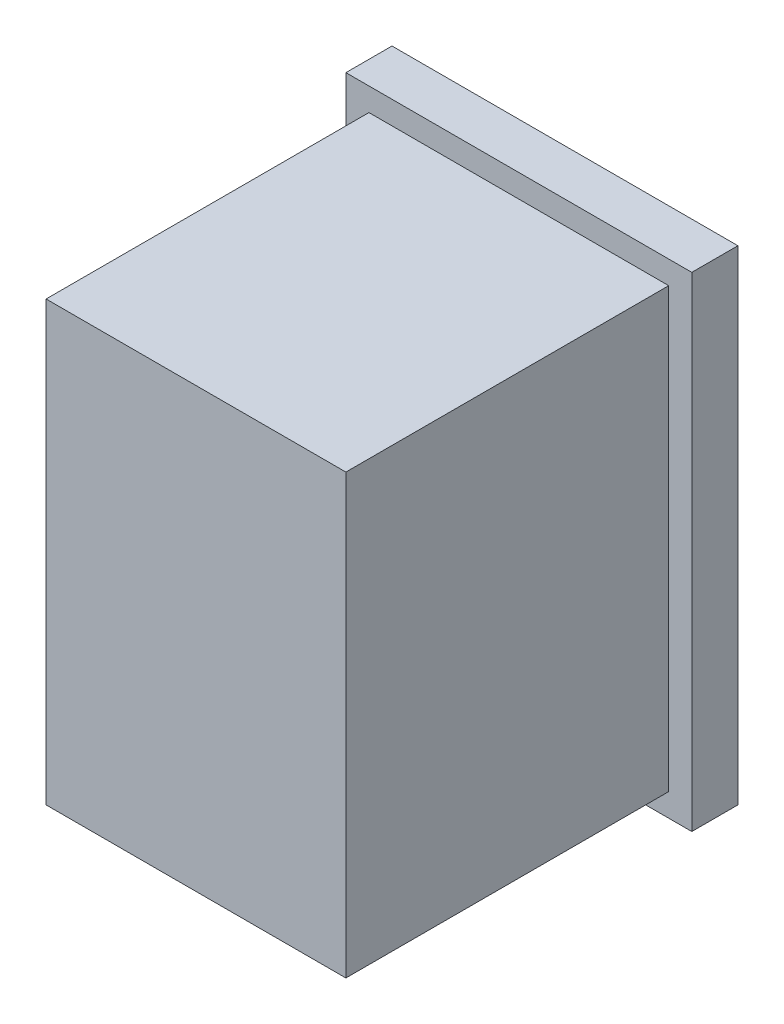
ISO-10303-21;
HEADER;
FILE_DESCRIPTION(('STEP AP214'),'2;1');
FILE_NAME('part.step','',(''),(''),'','','');
FILE_SCHEMA(('AUTOMOTIVE_DESIGN { 1 0 10303 214 1 1 1 1 }'));
ENDSEC;
DATA;
#1=APPLICATION_CONTEXT('core data for automotive mechanical design processes');
#2=APPLICATION_PROTOCOL_DEFINITION('international standard','automotive_design',2000,#1);
#3=PRODUCT_CONTEXT('',#1,'mechanical');
#4=PRODUCT('Part','Part','',(#3));
#5=PRODUCT_RELATED_PRODUCT_CATEGORY('part','',(#4));
#6=PRODUCT_DEFINITION_FORMATION('','',#4);
#7=PRODUCT_DEFINITION_CONTEXT('part definition',#1,'design');
#8=PRODUCT_DEFINITION('design','',#6,#7);
#9=PRODUCT_DEFINITION_SHAPE('','',#8);
#10=(LENGTH_UNIT() NAMED_UNIT(*) SI_UNIT(.MILLI.,.METRE.));
#11=(NAMED_UNIT(*) PLANE_ANGLE_UNIT() SI_UNIT($,.RADIAN.));
#12=(NAMED_UNIT(*) SI_UNIT($,.STERADIAN.) SOLID_ANGLE_UNIT());
#13=UNCERTAINTY_MEASURE_WITH_UNIT(LENGTH_MEASURE(1.E-05),#10,'distance_accuracy_value','');
#14=(GEOMETRIC_REPRESENTATION_CONTEXT(3) GLOBAL_UNCERTAINTY_ASSIGNED_CONTEXT((#13)) GLOBAL_UNIT_ASSIGNED_CONTEXT((#10,
#11,#12)) REPRESENTATION_CONTEXT('',''));
#15=CARTESIAN_POINT('',(0.,0.,0.));
#16=DIRECTION('',(0.,0.,1.));
#17=DIRECTION('',(1.,0.,0.));
#18=AXIS2_PLACEMENT_3D('',#15,#16,#17);
#19=CARTESIAN_POINT('',(5.5,-8.,11.));
#20=DIRECTION('',(0.,0.,-1.));
#21=DIRECTION('',(-1.,0.,0.));
#22=AXIS2_PLACEMENT_3D('',#19,#20,#21);
#23=PLANE('',#22);
#24=DIRECTION('',(0.,-1.,0.));
#25=VECTOR('',#24,1.);
#26=CARTESIAN_POINT('',(5.5,8.,11.));
#27=LINE('',#26,#25);
#28=CARTESIAN_POINT('',(5.5,8.,11.));
#29=VERTEX_POINT('',#28);
#30=CARTESIAN_POINT('',(5.5,-8.,11.));
#31=VERTEX_POINT('',#30);
#32=EDGE_CURVE('E175',#29,#31,#27,.T.);
#33=ORIENTED_EDGE('',*,*,#32,.T.);
#34=DIRECTION('',(-1.,0.,0.));
#35=VECTOR('',#34,1.);
#36=CARTESIAN_POINT('',(5.5,-8.,11.));
#37=LINE('',#36,#35);
#38=CARTESIAN_POINT('',(-5.5,-8.,11.));
#39=VERTEX_POINT('',#38);
#40=EDGE_CURVE('E178',#31,#39,#37,.T.);
#41=ORIENTED_EDGE('',*,*,#40,.T.);
#42=DIRECTION('',(0.,1.,0.));
#43=VECTOR('',#42,1.);
#44=CARTESIAN_POINT('',(-5.5,8.,11.));
#45=LINE('',#44,#43);
#46=CARTESIAN_POINT('',(-5.5,8.,11.));
#47=VERTEX_POINT('',#46);
#48=EDGE_CURVE('E182',#39,#47,#45,.T.);
#49=ORIENTED_EDGE('',*,*,#48,.T.);
#50=DIRECTION('',(1.,0.,0.));
#51=VECTOR('',#50,1.);
#52=CARTESIAN_POINT('',(5.5,8.,11.));
#53=LINE('',#52,#51);
#54=EDGE_CURVE('E185',#47,#29,#53,.T.);
#55=ORIENTED_EDGE('',*,*,#54,.T.);
#56=EDGE_LOOP('',(#33,#41,#49,#55));
#57=FACE_BOUND('',#56,.T.);
#58=DIRECTION('',(-1.,0.,0.));
#59=VECTOR('',#58,1.);
#60=CARTESIAN_POINT('',(5.,-7.5,11.));
#61=LINE('',#60,#59);
#62=CARTESIAN_POINT('',(5.,-7.5,11.));
#63=VERTEX_POINT('',#62);
#64=CARTESIAN_POINT('',(-5.,-7.5,11.));
#65=VERTEX_POINT('',#64);
#66=EDGE_CURVE('E441',#63,#65,#61,.T.);
#67=ORIENTED_EDGE('',*,*,#66,.F.);
#68=DIRECTION('',(0.,-1.,0.));
#69=VECTOR('',#68,1.);
#70=CARTESIAN_POINT('',(5.,0.,11.));
#71=LINE('',#70,#69);
#72=CARTESIAN_POINT('',(5.,0.,11.));
#73=VERTEX_POINT('',#72);
#74=EDGE_CURVE('E167',#73,#63,#71,.T.);
#75=ORIENTED_EDGE('',*,*,#74,.F.);
#76=DIRECTION('',(1.,0.,0.));
#77=VECTOR('',#76,1.);
#78=CARTESIAN_POINT('',(5.,0.,11.));
#79=LINE('',#78,#77);
#80=CARTESIAN_POINT('',(-5.,0.,11.));
#81=VERTEX_POINT('',#80);
#82=EDGE_CURVE('E163',#81,#73,#79,.T.);
#83=ORIENTED_EDGE('',*,*,#82,.F.);
#84=DIRECTION('',(0.,1.,0.));
#85=VECTOR('',#84,1.);
#86=CARTESIAN_POINT('',(-5.,0.,11.));
#87=LINE('',#86,#85);
#88=EDGE_CURVE('E438',#65,#81,#87,.T.);
#89=ORIENTED_EDGE('',*,*,#88,.F.);
#90=EDGE_LOOP('',(#67,#75,#83,#89));
#91=FACE_BOUND('',#90,.T.);
#92=ADVANCED_FACE('F31',(#57,#91),#23,.T.);
#93=CARTESIAN_POINT('',(6.5,9.5,14.));
#94=DIRECTION('',(-1.,0.,0.));
#95=DIRECTION('',(0.,0.,1.));
#96=AXIS2_PLACEMENT_3D('',#93,#94,#95);
#97=PLANE('',#96);
#98=DIRECTION('',(0.,1.,0.));
#99=VECTOR('',#98,1.);
#100=CARTESIAN_POINT('',(6.5,9.5,0.));
#101=LINE('',#100,#99);
#102=CARTESIAN_POINT('',(6.5,-9.5,0.));
#103=VERTEX_POINT('',#102);
#104=CARTESIAN_POINT('',(6.5,9.5,0.));
#105=VERTEX_POINT('',#104);
#106=EDGE_CURVE('E233',#103,#105,#101,.T.);
#107=ORIENTED_EDGE('',*,*,#106,.T.);
#108=DIRECTION('',(0.,0.,-1.));
#109=VECTOR('',#108,1.);
#110=CARTESIAN_POINT('',(6.5,9.5,14.));
#111=LINE('',#110,#109);
#112=CARTESIAN_POINT('',(6.5,9.5,14.));
#113=VERTEX_POINT('',#112);
#114=EDGE_CURVE('E11',#113,#105,#111,.T.);
#115=ORIENTED_EDGE('',*,*,#114,.F.);
#116=DIRECTION('',(0.,1.,0.));
#117=VECTOR('',#116,1.);
#118=CARTESIAN_POINT('',(6.5,9.5,14.));
#119=LINE('',#118,#117);
#120=CARTESIAN_POINT('',(6.5,-9.5,14.));
#121=VERTEX_POINT('',#120);
#122=EDGE_CURVE('E234',#121,#113,#119,.T.);
#123=ORIENTED_EDGE('',*,*,#122,.F.);
#124=DIRECTION('',(0.,0.,-1.));
#125=VECTOR('',#124,1.);
#126=CARTESIAN_POINT('',(6.5,-9.5,14.));
#127=LINE('',#126,#125);
#128=EDGE_CURVE('E244',#121,#103,#127,.T.);
#129=ORIENTED_EDGE('',*,*,#128,.T.);
#130=EDGE_LOOP('',(#107,#115,#123,#129));
#131=FACE_BOUND('',#130,.T.);
#132=ADVANCED_FACE('F33',(#131),#97,.F.);
#133=CARTESIAN_POINT('',(6.5,9.5,14.));
#134=DIRECTION('',(0.,-1.,0.));
#135=DIRECTION('',(0.,0.,-1.));
#136=AXIS2_PLACEMENT_3D('',#133,#134,#135);
#137=PLANE('',#136);
#138=DIRECTION('',(-1.,0.,0.));
#139=VECTOR('',#138,1.);
#140=CARTESIAN_POINT('',(6.5,9.5,0.));
#141=LINE('',#140,#139);
#142=CARTESIAN_POINT('',(-6.5,9.5,0.));
#143=VERTEX_POINT('',#142);
#144=EDGE_CURVE('E247',#105,#143,#141,.T.);
#145=ORIENTED_EDGE('',*,*,#144,.T.);
#146=DIRECTION('',(0.,0.,-1.));
#147=VECTOR('',#146,1.);
#148=CARTESIAN_POINT('',(-6.5,9.5,14.));
#149=LINE('',#148,#147);
#150=CARTESIAN_POINT('',(-6.5,9.5,14.));
#151=VERTEX_POINT('',#150);
#152=EDGE_CURVE('E39',#151,#143,#149,.T.);
#153=ORIENTED_EDGE('',*,*,#152,.F.);
#154=DIRECTION('',(-1.,0.,0.));
#155=VECTOR('',#154,1.);
#156=CARTESIAN_POINT('',(6.5,9.5,14.));
#157=LINE('',#156,#155);
#158=EDGE_CURVE('E237',#113,#151,#157,.T.);
#159=ORIENTED_EDGE('',*,*,#158,.F.);
#160=ORIENTED_EDGE('',*,*,#114,.T.);
#161=EDGE_LOOP('',(#145,#153,#159,#160));
#162=FACE_BOUND('',#161,.T.);
#163=ADVANCED_FACE('F266',(#162),#137,.F.);
#164=CARTESIAN_POINT('',(-6.5,9.5,14.));
#165=DIRECTION('',(1.,0.,0.));
#166=DIRECTION('',(0.,0.,-1.));
#167=AXIS2_PLACEMENT_3D('',#164,#165,#166);
#168=PLANE('',#167);
#169=DIRECTION('',(0.,-1.,0.));
#170=VECTOR('',#169,1.);
#171=CARTESIAN_POINT('',(-6.5,9.5,0.));
#172=LINE('',#171,#170);
#173=CARTESIAN_POINT('',(-6.5,-9.5,0.));
#174=VERTEX_POINT('',#173);
#175=EDGE_CURVE('E250',#143,#174,#172,.T.);
#176=ORIENTED_EDGE('',*,*,#175,.T.);
#177=DIRECTION('',(0.,0.,-1.));
#178=VECTOR('',#177,1.);
#179=CARTESIAN_POINT('',(-6.5,-9.5,14.));
#180=LINE('',#179,#178);
#181=CARTESIAN_POINT('',(-6.5,-9.5,14.));
#182=VERTEX_POINT('',#181);
#183=EDGE_CURVE('E257',#182,#174,#180,.T.);
#184=ORIENTED_EDGE('',*,*,#183,.F.);
#185=DIRECTION('',(0.,-1.,0.));
#186=VECTOR('',#185,1.);
#187=CARTESIAN_POINT('',(-6.5,9.5,14.));
#188=LINE('',#187,#186);
#189=EDGE_CURVE('E240',#151,#182,#188,.T.);
#190=ORIENTED_EDGE('',*,*,#189,.F.);
#191=ORIENTED_EDGE('',*,*,#152,.T.);
#192=EDGE_LOOP('',(#176,#184,#190,#191));
#193=FACE_BOUND('',#192,.T.);
#194=ADVANCED_FACE('F263',(#193),#168,.F.);
#195=CARTESIAN_POINT('',(6.5,-9.5,14.));
#196=DIRECTION('',(0.,1.,0.));
#197=DIRECTION('',(-1.,0.,0.));
#198=AXIS2_PLACEMENT_3D('',#195,#196,#197);
#199=PLANE('',#198);
#200=DIRECTION('',(1.,0.,0.));
#201=VECTOR('',#200,1.);
#202=CARTESIAN_POINT('',(6.5,-9.5,0.));
#203=LINE('',#202,#201);
#204=EDGE_CURVE('E238',#174,#103,#203,.T.);
#205=ORIENTED_EDGE('',*,*,#204,.T.);
#206=ORIENTED_EDGE('',*,*,#128,.F.);
#207=DIRECTION('',(1.,0.,0.));
#208=VECTOR('',#207,1.);
#209=CARTESIAN_POINT('',(6.5,-9.5,14.));
#210=LINE('',#209,#208);
#211=EDGE_CURVE('E242',#182,#121,#210,.T.);
#212=ORIENTED_EDGE('',*,*,#211,.F.);
#213=ORIENTED_EDGE('',*,*,#183,.T.);
#214=EDGE_LOOP('',(#205,#206,#212,#213));
#215=FACE_BOUND('',#214,.T.);
#216=ADVANCED_FACE('F272',(#215),#199,.F.);
#217=CARTESIAN_POINT('',(6.5,-9.5,14.));
#218=DIRECTION('',(0.,0.,-1.));
#219=DIRECTION('',(-1.,0.,0.));
#220=AXIS2_PLACEMENT_3D('',#217,#218,#219);
#221=PLANE('',#220);
#222=ORIENTED_EDGE('',*,*,#122,.T.);
#223=ORIENTED_EDGE('',*,*,#158,.T.);
#224=ORIENTED_EDGE('',*,*,#189,.T.);
#225=ORIENTED_EDGE('',*,*,#211,.T.);
#226=EDGE_LOOP('',(#222,#223,#224,#225));
#227=FACE_BOUND('',#226,.T.);
#228=ADVANCED_FACE('F277',(#227),#221,.F.);
#229=CARTESIAN_POINT('',(7.5,-10.5,0.));
#230=DIRECTION('',(0.,0.,-1.));
#231=DIRECTION('',(-1.,0.,0.));
#232=AXIS2_PLACEMENT_3D('',#229,#230,#231);
#233=PLANE('',#232);
#234=DIRECTION('',(0.,-1.,0.));
#235=VECTOR('',#234,1.);
#236=CARTESIAN_POINT('',(7.5,10.5,0.));
#237=LINE('',#236,#235);
#238=CARTESIAN_POINT('',(7.5,10.5,0.));
#239=VERTEX_POINT('',#238);
#240=CARTESIAN_POINT('',(7.5,-10.5,0.));
#241=VERTEX_POINT('',#240);
#242=EDGE_CURVE('E198',#239,#241,#237,.T.);
#243=ORIENTED_EDGE('',*,*,#242,.F.);
#244=DIRECTION('',(1.,0.,0.));
#245=VECTOR('',#244,1.);
#246=CARTESIAN_POINT('',(7.5,10.5,0.));
#247=LINE('',#246,#245);
#248=CARTESIAN_POINT('',(-7.5,10.5,0.));
#249=VERTEX_POINT('',#248);
#250=EDGE_CURVE('E208',#249,#239,#247,.T.);
#251=ORIENTED_EDGE('',*,*,#250,.F.);
#252=DIRECTION('',(0.,1.,0.));
#253=VECTOR('',#252,1.);
#254=CARTESIAN_POINT('',(-7.5,10.5,0.));
#255=LINE('',#254,#253);
#256=CARTESIAN_POINT('',(-7.5,-10.5,0.));
#257=VERTEX_POINT('',#256);
#258=EDGE_CURVE('E219',#257,#249,#255,.T.);
#259=ORIENTED_EDGE('',*,*,#258,.F.);
#260=DIRECTION('',(-1.,0.,0.));
#261=VECTOR('',#260,1.);
#262=CARTESIAN_POINT('',(7.5,-10.5,0.));
#263=LINE('',#262,#261);
#264=EDGE_CURVE('E217',#241,#257,#263,.T.);
#265=ORIENTED_EDGE('',*,*,#264,.F.);
#266=EDGE_LOOP('',(#243,#251,#259,#265));
#267=FACE_BOUND('',#266,.T.);
#268=ORIENTED_EDGE('',*,*,#144,.F.);
#269=ORIENTED_EDGE('',*,*,#106,.F.);
#270=ORIENTED_EDGE('',*,*,#204,.F.);
#271=ORIENTED_EDGE('',*,*,#175,.F.);
#272=EDGE_LOOP('',(#268,#269,#270,#271));
#273=FACE_BOUND('',#272,.T.);
#274=ADVANCED_FACE('F269',(#267,#273),#233,.F.);
#275=CARTESIAN_POINT('',(7.5,10.5,-2.));
#276=DIRECTION('',(-1.,0.,0.));
#277=DIRECTION('',(0.,-1.,0.));
#278=AXIS2_PLACEMENT_3D('',#275,#276,#277);
#279=PLANE('',#278);
#280=ORIENTED_EDGE('',*,*,#242,.T.);
#281=DIRECTION('',(0.,0.,1.));
#282=VECTOR('',#281,1.);
#283=CARTESIAN_POINT('',(7.5,-10.5,-2.));
#284=LINE('',#283,#282);
#285=CARTESIAN_POINT('',(7.5,-10.5,-2.));
#286=VERTEX_POINT('',#285);
#287=EDGE_CURVE('E230',#286,#241,#284,.T.);
#288=ORIENTED_EDGE('',*,*,#287,.F.);
#289=DIRECTION('',(0.,-1.,0.));
#290=VECTOR('',#289,1.);
#291=CARTESIAN_POINT('',(7.5,10.5,-2.));
#292=LINE('',#291,#290);
#293=CARTESIAN_POINT('',(7.5,10.5,-2.));
#294=VERTEX_POINT('',#293);
#295=EDGE_CURVE('E204',#294,#286,#292,.T.);
#296=ORIENTED_EDGE('',*,*,#295,.F.);
#297=DIRECTION('',(0.,0.,1.));
#298=VECTOR('',#297,1.);
#299=CARTESIAN_POINT('',(7.5,10.5,-2.));
#300=LINE('',#299,#298);
#301=EDGE_CURVE('E214',#294,#239,#300,.T.);
#302=ORIENTED_EDGE('',*,*,#301,.T.);
#303=EDGE_LOOP('',(#280,#288,#296,#302));
#304=FACE_BOUND('',#303,.T.);
#305=ADVANCED_FACE('F284',(#304),#279,.F.);
#306=CARTESIAN_POINT('',(7.5,-10.5,-2.));
#307=DIRECTION('',(0.,1.,0.));
#308=DIRECTION('',(0.,0.,1.));
#309=AXIS2_PLACEMENT_3D('',#306,#307,#308);
#310=PLANE('',#309);
#311=ORIENTED_EDGE('',*,*,#264,.T.);
#312=DIRECTION('',(0.,0.,1.));
#313=VECTOR('',#312,1.);
#314=CARTESIAN_POINT('',(-7.5,-10.5,-2.));
#315=LINE('',#314,#313);
#316=CARTESIAN_POINT('',(-7.5,-10.5,-2.));
#317=VERTEX_POINT('',#316);
#318=EDGE_CURVE('E227',#317,#257,#315,.T.);
#319=ORIENTED_EDGE('',*,*,#318,.F.);
#320=DIRECTION('',(-1.,0.,0.));
#321=VECTOR('',#320,1.);
#322=CARTESIAN_POINT('',(7.5,-10.5,-2.));
#323=LINE('',#322,#321);
#324=EDGE_CURVE('E207',#286,#317,#323,.T.);
#325=ORIENTED_EDGE('',*,*,#324,.F.);
#326=ORIENTED_EDGE('',*,*,#287,.T.);
#327=EDGE_LOOP('',(#311,#319,#325,#326));
#328=FACE_BOUND('',#327,.T.);
#329=ADVANCED_FACE('F326',(#328),#310,.F.);
#330=CARTESIAN_POINT('',(-7.5,10.5,-2.));
#331=DIRECTION('',(1.,0.,0.));
#332=DIRECTION('',(0.,1.,0.));
#333=AXIS2_PLACEMENT_3D('',#330,#331,#332);
#334=PLANE('',#333);
#335=ORIENTED_EDGE('',*,*,#258,.T.);
#336=DIRECTION('',(0.,0.,1.));
#337=VECTOR('',#336,1.);
#338=CARTESIAN_POINT('',(-7.5,10.5,-2.));
#339=LINE('',#338,#337);
#340=CARTESIAN_POINT('',(-7.5,10.5,-2.));
#341=VERTEX_POINT('',#340);
#342=EDGE_CURVE('E224',#341,#249,#339,.T.);
#343=ORIENTED_EDGE('',*,*,#342,.F.);
#344=DIRECTION('',(0.,1.,0.));
#345=VECTOR('',#344,1.);
#346=CARTESIAN_POINT('',(-7.5,10.5,-2.));
#347=LINE('',#346,#345);
#348=EDGE_CURVE('E210',#317,#341,#347,.T.);
#349=ORIENTED_EDGE('',*,*,#348,.F.);
#350=ORIENTED_EDGE('',*,*,#318,.T.);
#351=EDGE_LOOP('',(#335,#343,#349,#350));
#352=FACE_BOUND('',#351,.T.);
#353=ADVANCED_FACE('F322',(#352),#334,.F.);
#354=CARTESIAN_POINT('',(7.5,10.5,-2.));
#355=DIRECTION('',(0.,-1.,0.));
#356=DIRECTION('',(0.,0.,-1.));
#357=AXIS2_PLACEMENT_3D('',#354,#355,#356);
#358=PLANE('',#357);
#359=ORIENTED_EDGE('',*,*,#250,.T.);
#360=ORIENTED_EDGE('',*,*,#301,.F.);
#361=DIRECTION('',(1.,0.,0.));
#362=VECTOR('',#361,1.);
#363=CARTESIAN_POINT('',(7.5,10.5,-2.));
#364=LINE('',#363,#362);
#365=EDGE_CURVE('E212',#341,#294,#364,.T.);
#366=ORIENTED_EDGE('',*,*,#365,.F.);
#367=ORIENTED_EDGE('',*,*,#342,.T.);
#368=EDGE_LOOP('',(#359,#360,#366,#367));
#369=FACE_BOUND('',#368,.T.);
#370=ADVANCED_FACE('F317',(#369),#358,.F.);
#371=CARTESIAN_POINT('',(7.5,-10.5,-2.));
#372=DIRECTION('',(0.,0.,-1.));
#373=DIRECTION('',(-1.,0.,0.));
#374=AXIS2_PLACEMENT_3D('',#371,#372,#373);
#375=PLANE('',#374);
#376=DIRECTION('',(0.,-1.,0.));
#377=VECTOR('',#376,1.);
#378=CARTESIAN_POINT('',(5.5,8.,-2.));
#379=LINE('',#378,#377);
#380=CARTESIAN_POINT('',(5.5,8.,-2.));
#381=VERTEX_POINT('',#380);
#382=CARTESIAN_POINT('',(5.5,-8.,-2.));
#383=VERTEX_POINT('',#382);
#384=EDGE_CURVE('E54',#381,#383,#379,.T.);
#385=ORIENTED_EDGE('',*,*,#384,.F.);
#386=DIRECTION('',(1.,0.,0.));
#387=VECTOR('',#386,1.);
#388=CARTESIAN_POINT('',(5.5,8.,-2.));
#389=LINE('',#388,#387);
#390=CARTESIAN_POINT('',(-5.5,8.,-2.));
#391=VERTEX_POINT('',#390);
#392=EDGE_CURVE('E179',#391,#381,#389,.T.);
#393=ORIENTED_EDGE('',*,*,#392,.F.);
#394=DIRECTION('',(0.,1.,0.));
#395=VECTOR('',#394,1.);
#396=CARTESIAN_POINT('',(-5.5,8.,-2.));
#397=LINE('',#396,#395);
#398=CARTESIAN_POINT('',(-5.5,-8.,-2.));
#399=VERTEX_POINT('',#398);
#400=EDGE_CURVE('E191',#399,#391,#397,.T.);
#401=ORIENTED_EDGE('',*,*,#400,.F.);
#402=DIRECTION('',(-1.,0.,0.));
#403=VECTOR('',#402,1.);
#404=CARTESIAN_POINT('',(5.5,-8.,-2.));
#405=LINE('',#404,#403);
#406=EDGE_CURVE('E170',#383,#399,#405,.T.);
#407=ORIENTED_EDGE('',*,*,#406,.F.);
#408=EDGE_LOOP('',(#385,#393,#401,#407));
#409=FACE_BOUND('',#408,.T.);
#410=ORIENTED_EDGE('',*,*,#295,.T.);
#411=ORIENTED_EDGE('',*,*,#324,.T.);
#412=ORIENTED_EDGE('',*,*,#348,.T.);
#413=ORIENTED_EDGE('',*,*,#365,.T.);
#414=EDGE_LOOP('',(#410,#411,#412,#413));
#415=FACE_BOUND('',#414,.T.);
#416=ADVANCED_FACE('F315',(#409,#415),#375,.T.);
#417=CARTESIAN_POINT('',(5.5,8.,11.));
#418=DIRECTION('',(1.,0.,0.));
#419=DIRECTION('',(0.,1.,0.));
#420=AXIS2_PLACEMENT_3D('',#417,#418,#419);
#421=PLANE('',#420);
#422=ORIENTED_EDGE('',*,*,#384,.T.);
#423=DIRECTION('',(0.,0.,-1.));
#424=VECTOR('',#423,1.);
#425=CARTESIAN_POINT('',(5.5,-8.,11.));
#426=LINE('',#425,#424);
#427=EDGE_CURVE('E187',#31,#383,#426,.T.);
#428=ORIENTED_EDGE('',*,*,#427,.F.);
#429=ORIENTED_EDGE('',*,*,#32,.F.);
#430=DIRECTION('',(0.,0.,-1.));
#431=VECTOR('',#430,1.);
#432=CARTESIAN_POINT('',(5.5,8.,11.));
#433=LINE('',#432,#431);
#434=EDGE_CURVE('E196',#29,#381,#433,.T.);
#435=ORIENTED_EDGE('',*,*,#434,.T.);
#436=EDGE_LOOP('',(#422,#428,#429,#435));
#437=FACE_BOUND('',#436,.T.);
#438=ADVANCED_FACE('F305',(#437),#421,.F.);
#439=CARTESIAN_POINT('',(5.5,8.,11.));
#440=DIRECTION('',(0.,1.,0.));
#441=DIRECTION('',(0.,0.,1.));
#442=AXIS2_PLACEMENT_3D('',#439,#440,#441);
#443=PLANE('',#442);
#444=ORIENTED_EDGE('',*,*,#392,.T.);
#445=ORIENTED_EDGE('',*,*,#434,.F.);
#446=ORIENTED_EDGE('',*,*,#54,.F.);
#447=DIRECTION('',(0.,0.,-1.));
#448=VECTOR('',#447,1.);
#449=CARTESIAN_POINT('',(-5.5,8.,11.));
#450=LINE('',#449,#448);
#451=EDGE_CURVE('E199',#47,#391,#450,.T.);
#452=ORIENTED_EDGE('',*,*,#451,.T.);
#453=EDGE_LOOP('',(#444,#445,#446,#452));
#454=FACE_BOUND('',#453,.T.);
#455=ADVANCED_FACE('F301',(#454),#443,.F.);
#456=CARTESIAN_POINT('',(-5.5,8.,11.));
#457=DIRECTION('',(-1.,0.,0.));
#458=DIRECTION('',(0.,-1.,0.));
#459=AXIS2_PLACEMENT_3D('',#456,#457,#458);
#460=PLANE('',#459);
#461=ORIENTED_EDGE('',*,*,#400,.T.);
#462=ORIENTED_EDGE('',*,*,#451,.F.);
#463=ORIENTED_EDGE('',*,*,#48,.F.);
#464=DIRECTION('',(0.,0.,-1.));
#465=VECTOR('',#464,1.);
#466=CARTESIAN_POINT('',(-5.5,-8.,11.));
#467=LINE('',#466,#465);
#468=EDGE_CURVE('E201',#39,#399,#467,.T.);
#469=ORIENTED_EDGE('',*,*,#468,.T.);
#470=EDGE_LOOP('',(#461,#462,#463,#469));
#471=FACE_BOUND('',#470,.T.);
#472=ADVANCED_FACE('F304',(#471),#460,.F.);
#473=CARTESIAN_POINT('',(5.5,-8.,11.));
#474=DIRECTION('',(0.,-1.,0.));
#475=DIRECTION('',(0.,0.,-1.));
#476=AXIS2_PLACEMENT_3D('',#473,#474,#475);
#477=PLANE('',#476);
#478=ORIENTED_EDGE('',*,*,#406,.T.);
#479=ORIENTED_EDGE('',*,*,#468,.F.);
#480=ORIENTED_EDGE('',*,*,#40,.F.);
#481=ORIENTED_EDGE('',*,*,#427,.T.);
#482=EDGE_LOOP('',(#478,#479,#480,#481));
#483=FACE_BOUND('',#482,.T.);
#484=ADVANCED_FACE('F309',(#483),#477,.F.);
#485=CARTESIAN_POINT('',(5.,0.,-2.5));
#486=DIRECTION('',(-1.,0.,0.));
#487=DIRECTION('',(0.,0.,1.));
#488=AXIS2_PLACEMENT_3D('',#485,#486,#487);
#489=PLANE('',#488);
#490=ORIENTED_EDGE('',*,*,#74,.T.);
#491=DIRECTION('',(0.,0.,1.));
#492=VECTOR('',#491,1.);
#493=CARTESIAN_POINT('',(5.,-7.5,-2.5));
#494=LINE('',#493,#492);
#495=CARTESIAN_POINT('',(5.,-7.5,-2.5));
#496=VERTEX_POINT('',#495);
#497=EDGE_CURVE('E148',#496,#63,#494,.T.);
#498=ORIENTED_EDGE('',*,*,#497,.F.);
#499=DIRECTION('',(0.,-1.,0.));
#500=VECTOR('',#499,1.);
#501=CARTESIAN_POINT('',(5.,0.,-2.5));
#502=LINE('',#501,#500);
#503=CARTESIAN_POINT('',(5.,0.,-2.5));
#504=VERTEX_POINT('',#503);
#505=EDGE_CURVE('E155',#504,#496,#502,.T.);
#506=ORIENTED_EDGE('',*,*,#505,.F.);
#507=DIRECTION('',(0.,0.,1.));
#508=VECTOR('',#507,1.);
#509=CARTESIAN_POINT('',(5.,0.,-2.5));
#510=LINE('',#509,#508);
#511=EDGE_CURVE('E436',#504,#73,#510,.T.);
#512=ORIENTED_EDGE('',*,*,#511,.T.);
#513=EDGE_LOOP('',(#490,#498,#506,#512));
#514=FACE_BOUND('',#513,.T.);
#515=ADVANCED_FACE('F165',(#514),#489,.F.);
#516=CARTESIAN_POINT('',(5.,-7.5,-2.5));
#517=DIRECTION('',(0.,1.,0.));
#518=DIRECTION('',(0.,0.,1.));
#519=AXIS2_PLACEMENT_3D('',#516,#517,#518);
#520=PLANE('',#519);
#521=ORIENTED_EDGE('',*,*,#66,.T.);
#522=DIRECTION('',(0.,0.,1.));
#523=VECTOR('',#522,1.);
#524=CARTESIAN_POINT('',(-5.,-7.5,-2.5));
#525=LINE('',#524,#523);
#526=CARTESIAN_POINT('',(-5.,-7.5,-2.5));
#527=VERTEX_POINT('',#526);
#528=EDGE_CURVE('E151',#527,#65,#525,.T.);
#529=ORIENTED_EDGE('',*,*,#528,.F.);
#530=DIRECTION('',(-1.,0.,0.));
#531=VECTOR('',#530,1.);
#532=CARTESIAN_POINT('',(5.,-7.5,-2.5));
#533=LINE('',#532,#531);
#534=EDGE_CURVE('E144',#496,#527,#533,.T.);
#535=ORIENTED_EDGE('',*,*,#534,.F.);
#536=ORIENTED_EDGE('',*,*,#497,.T.);
#537=EDGE_LOOP('',(#521,#529,#535,#536));
#538=FACE_BOUND('',#537,.T.);
#539=ADVANCED_FACE('F146',(#538),#520,.F.);
#540=CARTESIAN_POINT('',(-5.,0.,-2.5));
#541=DIRECTION('',(1.,0.,0.));
#542=DIRECTION('',(0.,1.,0.));
#543=AXIS2_PLACEMENT_3D('',#540,#541,#542);
#544=PLANE('',#543);
#545=ORIENTED_EDGE('',*,*,#88,.T.);
#546=DIRECTION('',(0.,0.,1.));
#547=VECTOR('',#546,1.);
#548=CARTESIAN_POINT('',(-5.,0.,-2.5));
#549=LINE('',#548,#547);
#550=CARTESIAN_POINT('',(-5.,0.,-2.5));
#551=VERTEX_POINT('',#550);
#552=EDGE_CURVE('E46',#551,#81,#549,.T.);
#553=ORIENTED_EDGE('',*,*,#552,.F.);
#554=DIRECTION('',(0.,1.,0.));
#555=VECTOR('',#554,1.);
#556=CARTESIAN_POINT('',(-5.,0.,-2.5));
#557=LINE('',#556,#555);
#558=EDGE_CURVE('E154',#527,#551,#557,.T.);
#559=ORIENTED_EDGE('',*,*,#558,.F.);
#560=ORIENTED_EDGE('',*,*,#528,.T.);
#561=EDGE_LOOP('',(#545,#553,#559,#560));
#562=FACE_BOUND('',#561,.T.);
#563=ADVANCED_FACE('F406',(#562),#544,.F.);
#564=CARTESIAN_POINT('',(5.,0.,-2.5));
#565=DIRECTION('',(0.,-1.,0.));
#566=DIRECTION('',(0.,0.,-1.));
#567=AXIS2_PLACEMENT_3D('',#564,#565,#566);
#568=PLANE('',#567);
#569=ORIENTED_EDGE('',*,*,#82,.T.);
#570=ORIENTED_EDGE('',*,*,#511,.F.);
#571=DIRECTION('',(1.,0.,0.));
#572=VECTOR('',#571,1.);
#573=CARTESIAN_POINT('',(5.,0.,-2.5));
#574=LINE('',#573,#572);
#575=EDGE_CURVE('E159',#551,#504,#574,.T.);
#576=ORIENTED_EDGE('',*,*,#575,.F.);
#577=ORIENTED_EDGE('',*,*,#552,.T.);
#578=EDGE_LOOP('',(#569,#570,#576,#577));
#579=FACE_BOUND('',#578,.T.);
#580=ADVANCED_FACE('F414',(#579),#568,.F.);
#581=CARTESIAN_POINT('',(5.,-7.5,-2.5));
#582=DIRECTION('',(0.,0.,-1.));
#583=DIRECTION('',(-1.,0.,0.));
#584=AXIS2_PLACEMENT_3D('',#581,#582,#583);
#585=PLANE('',#584);
#586=ORIENTED_EDGE('',*,*,#505,.T.);
#587=ORIENTED_EDGE('',*,*,#534,.T.);
#588=ORIENTED_EDGE('',*,*,#558,.T.);
#589=ORIENTED_EDGE('',*,*,#575,.T.);
#590=EDGE_LOOP('',(#586,#587,#588,#589));
#591=FACE_BOUND('',#590,.T.);
#592=ADVANCED_FACE('F158',(#591),#585,.T.);
#593=CLOSED_SHELL('',(#92,#132,#163,#194,#216,#228,#274,#305,#329,#353,#370,#416,#438,#455,#472,
#484,#515,#539,#563,#580,#592));
#594=MANIFOLD_SOLID_BREP('B2',#593);
#595=ADVANCED_BREP_SHAPE_REPRESENTATION('',(#18,#594),#14);
#596=SHAPE_DEFINITION_REPRESENTATION(#9,#595);
ENDSEC;
END-ISO-10303-21;
